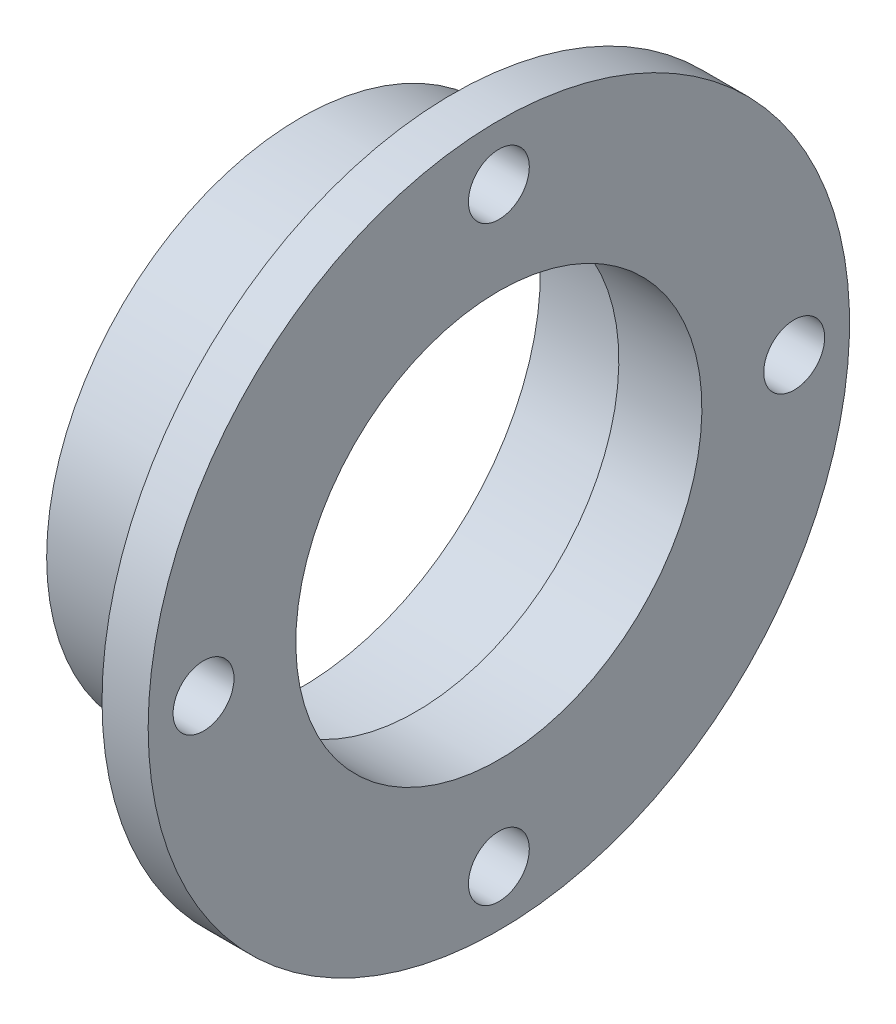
ISO-10303-21;
HEADER;
FILE_DESCRIPTION(('STEP AP214'),'2;1');
FILE_NAME('part.step','',(''),(''),'','','');
FILE_SCHEMA(('AUTOMOTIVE_DESIGN { 1 0 10303 214 1 1 1 1 }'));
ENDSEC;
DATA;
#1=APPLICATION_CONTEXT('core data for automotive mechanical design processes');
#2=APPLICATION_PROTOCOL_DEFINITION('international standard','automotive_design',2000,#1);
#3=PRODUCT_CONTEXT('',#1,'mechanical');
#4=PRODUCT('Part','Part','',(#3));
#5=PRODUCT_RELATED_PRODUCT_CATEGORY('part','',(#4));
#6=PRODUCT_DEFINITION_FORMATION('','',#4);
#7=PRODUCT_DEFINITION_CONTEXT('part definition',#1,'design');
#8=PRODUCT_DEFINITION('design','',#6,#7);
#9=PRODUCT_DEFINITION_SHAPE('','',#8);
#10=(LENGTH_UNIT() NAMED_UNIT(*) SI_UNIT(.MILLI.,.METRE.));
#11=(NAMED_UNIT(*) PLANE_ANGLE_UNIT() SI_UNIT($,.RADIAN.));
#12=(NAMED_UNIT(*) SI_UNIT($,.STERADIAN.) SOLID_ANGLE_UNIT());
#13=UNCERTAINTY_MEASURE_WITH_UNIT(LENGTH_MEASURE(1.E-05),#10,'distance_accuracy_value','');
#14=(GEOMETRIC_REPRESENTATION_CONTEXT(3) GLOBAL_UNCERTAINTY_ASSIGNED_CONTEXT((#13)) GLOBAL_UNIT_ASSIGNED_CONTEXT((#10,
#11,#12)) REPRESENTATION_CONTEXT('',''));
#15=CARTESIAN_POINT('',(0.,0.,0.));
#16=DIRECTION('',(0.,0.,1.));
#17=DIRECTION('',(1.,0.,0.));
#18=AXIS2_PLACEMENT_3D('',#15,#16,#17);
#19=CARTESIAN_POINT('',(0.,0.,0.));
#20=DIRECTION('',(-1.,0.,0.));
#21=DIRECTION('',(0.,0.,1.));
#22=AXIS2_PLACEMENT_3D('',#19,#20,#21);
#23=CYLINDRICAL_SURFACE('',#22,38.);
#24=CARTESIAN_POINT('',(-5.,0.,0.));
#25=DIRECTION('',(-1.,0.,0.));
#26=DIRECTION('',(0.,0.,1.));
#27=AXIS2_PLACEMENT_3D('',#24,#25,#26);
#28=CIRCLE('',#27,38.);
#29=CARTESIAN_POINT('',(-5.,0.,38.));
#30=VERTEX_POINT('',#29);
#31=EDGE_CURVE('E81',#30,#30,#28,.T.);
#32=ORIENTED_EDGE('',*,*,#31,.F.);
#33=EDGE_LOOP('',(#32));
#34=FACE_BOUND('',#33,.T.);
#35=CARTESIAN_POINT('',(0.,0.,0.));
#36=DIRECTION('',(-1.,0.,0.));
#37=DIRECTION('',(0.,0.,1.));
#38=AXIS2_PLACEMENT_3D('',#35,#36,#37);
#39=CIRCLE('',#38,38.);
#40=CARTESIAN_POINT('',(0.,0.,38.));
#41=VERTEX_POINT('',#40);
#42=EDGE_CURVE('E10',#41,#41,#39,.T.);
#43=ORIENTED_EDGE('',*,*,#42,.T.);
#44=EDGE_LOOP('',(#43));
#45=FACE_BOUND('',#44,.T.);
#46=ADVANCED_FACE('F29',(#34,#45),#23,.T.);
#47=CARTESIAN_POINT('',(0.,0.,0.));
#48=DIRECTION('',(-1.,0.,0.));
#49=DIRECTION('',(0.,0.,1.));
#50=AXIS2_PLACEMENT_3D('',#47,#48,#49);
#51=PLANE('',#50);
#52=CARTESIAN_POINT('',(0.,3.35182402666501E-13,-32.));
#53=DIRECTION('',(1.,0.,0.));
#54=DIRECTION('',(0.,0.,-1.));
#55=AXIS2_PLACEMENT_3D('',#52,#53,#54);
#56=CIRCLE('',#55,3.3);
#57=CARTESIAN_POINT('',(0.,3.35182402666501E-13,-35.3));
#58=VERTEX_POINT('',#57);
#59=EDGE_CURVE('E65',#58,#58,#56,.T.);
#60=ORIENTED_EDGE('',*,*,#59,.F.);
#61=EDGE_LOOP('',(#60));
#62=FACE_BOUND('',#61,.T.);
#63=CARTESIAN_POINT('',(0.,-32.,-2.23454935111E-13));
#64=DIRECTION('',(1.,0.,0.));
#65=DIRECTION('',(0.,0.,-1.));
#66=AXIS2_PLACEMENT_3D('',#63,#64,#65);
#67=CIRCLE('',#66,3.3);
#68=CARTESIAN_POINT('',(0.,-32.,-3.30000000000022));
#69=VERTEX_POINT('',#68);
#70=EDGE_CURVE('E55',#69,#69,#67,.T.);
#71=ORIENTED_EDGE('',*,*,#70,.F.);
#72=EDGE_LOOP('',(#71));
#73=FACE_BOUND('',#72,.T.);
#74=CARTESIAN_POINT('',(0.,-1.117274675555E-13,32.));
#75=DIRECTION('',(1.,0.,0.));
#76=DIRECTION('',(0.,0.,-1.));
#77=AXIS2_PLACEMENT_3D('',#74,#75,#76);
#78=CIRCLE('',#77,3.3);
#79=CARTESIAN_POINT('',(0.,-1.117274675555E-13,28.7));
#80=VERTEX_POINT('',#79);
#81=EDGE_CURVE('E52',#80,#80,#78,.T.);
#82=ORIENTED_EDGE('',*,*,#81,.F.);
#83=EDGE_LOOP('',(#82));
#84=FACE_BOUND('',#83,.T.);
#85=CARTESIAN_POINT('',(0.,32.,0.));
#86=DIRECTION('',(1.,0.,0.));
#87=DIRECTION('',(0.,0.,-1.));
#88=AXIS2_PLACEMENT_3D('',#85,#86,#87);
#89=CIRCLE('',#88,3.3);
#90=CARTESIAN_POINT('',(0.,32.,-3.3));
#91=VERTEX_POINT('',#90);
#92=EDGE_CURVE('E49',#91,#91,#89,.T.);
#93=ORIENTED_EDGE('',*,*,#92,.F.);
#94=EDGE_LOOP('',(#93));
#95=FACE_BOUND('',#94,.T.);
#96=CARTESIAN_POINT('',(0.,0.,0.));
#97=DIRECTION('',(1.,0.,0.));
#98=DIRECTION('',(0.,1.,0.));
#99=AXIS2_PLACEMENT_3D('',#96,#97,#98);
#100=CIRCLE('',#99,22.);
#101=CARTESIAN_POINT('',(0.,22.,0.));
#102=VERTEX_POINT('',#101);
#103=EDGE_CURVE('E78',#102,#102,#100,.T.);
#104=ORIENTED_EDGE('',*,*,#103,.F.);
#105=EDGE_LOOP('',(#104));
#106=FACE_BOUND('',#105,.T.);
#107=ORIENTED_EDGE('',*,*,#42,.F.);
#108=EDGE_LOOP('',(#107));
#109=FACE_BOUND('',#108,.T.);
#110=ADVANCED_FACE('F97',(#62,#73,#84,#95,#106,#109),#51,.F.);
#111=CARTESIAN_POINT('',(-21.5,27.5,0.));
#112=DIRECTION('',(1.,0.,0.));
#113=DIRECTION('',(0.,0.,-1.));
#114=AXIS2_PLACEMENT_3D('',#111,#112,#113);
#115=PLANE('',#114);
#116=CARTESIAN_POINT('',(-21.5,0.,0.));
#117=DIRECTION('',(1.,0.,0.));
#118=DIRECTION('',(0.,1.,0.));
#119=AXIS2_PLACEMENT_3D('',#116,#117,#118);
#120=CIRCLE('',#119,26.);
#121=CARTESIAN_POINT('',(-21.5,26.,0.));
#122=VERTEX_POINT('',#121);
#123=EDGE_CURVE('E48',#122,#122,#120,.T.);
#124=ORIENTED_EDGE('',*,*,#123,.T.);
#125=EDGE_LOOP('',(#124));
#126=FACE_BOUND('',#125,.T.);
#127=CARTESIAN_POINT('',(-21.5,0.,0.));
#128=DIRECTION('',(-1.,0.,0.));
#129=DIRECTION('',(0.,0.,1.));
#130=AXIS2_PLACEMENT_3D('',#127,#128,#129);
#131=CIRCLE('',#130,27.5);
#132=CARTESIAN_POINT('',(-21.5,0.,27.5));
#133=VERTEX_POINT('',#132);
#134=EDGE_CURVE('E36',#133,#133,#131,.T.);
#135=ORIENTED_EDGE('',*,*,#134,.T.);
#136=EDGE_LOOP('',(#135));
#137=FACE_BOUND('',#136,.T.);
#138=ADVANCED_FACE('F102',(#126,#137),#115,.F.);
#139=CARTESIAN_POINT('',(0.,0.,0.));
#140=DIRECTION('',(-1.,0.,0.));
#141=DIRECTION('',(0.,0.,1.));
#142=AXIS2_PLACEMENT_3D('',#139,#140,#141);
#143=CYLINDRICAL_SURFACE('',#142,27.5);
#144=ORIENTED_EDGE('',*,*,#134,.F.);
#145=EDGE_LOOP('',(#144));
#146=FACE_BOUND('',#145,.T.);
#147=CARTESIAN_POINT('',(-5.,0.,0.));
#148=DIRECTION('',(-1.,0.,0.));
#149=DIRECTION('',(0.,0.,1.));
#150=AXIS2_PLACEMENT_3D('',#147,#148,#149);
#151=CIRCLE('',#150,27.5);
#152=CARTESIAN_POINT('',(-5.,0.,27.5));
#153=VERTEX_POINT('',#152);
#154=EDGE_CURVE('E41',#153,#153,#151,.T.);
#155=ORIENTED_EDGE('',*,*,#154,.T.);
#156=EDGE_LOOP('',(#155));
#157=FACE_BOUND('',#156,.T.);
#158=ADVANCED_FACE('F86',(#146,#157),#143,.T.);
#159=CARTESIAN_POINT('',(-5.,38.,0.));
#160=DIRECTION('',(1.,0.,0.));
#161=DIRECTION('',(0.,0.,-1.));
#162=AXIS2_PLACEMENT_3D('',#159,#160,#161);
#163=PLANE('',#162);
#164=CARTESIAN_POINT('',(-5.,3.35182402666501E-13,-32.));
#165=DIRECTION('',(1.,0.,0.));
#166=DIRECTION('',(0.,0.,-1.));
#167=AXIS2_PLACEMENT_3D('',#164,#165,#166);
#168=CIRCLE('',#167,3.3);
#169=CARTESIAN_POINT('',(-5.,3.35182402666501E-13,-35.3));
#170=VERTEX_POINT('',#169);
#171=EDGE_CURVE('E32',#170,#170,#168,.T.);
#172=ORIENTED_EDGE('',*,*,#171,.T.);
#173=EDGE_LOOP('',(#172));
#174=FACE_BOUND('',#173,.T.);
#175=CARTESIAN_POINT('',(-5.,-32.,-2.23454935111E-13));
#176=DIRECTION('',(1.,0.,0.));
#177=DIRECTION('',(0.,0.,-1.));
#178=AXIS2_PLACEMENT_3D('',#175,#176,#177);
#179=CIRCLE('',#178,3.3);
#180=CARTESIAN_POINT('',(-5.,-32.,-3.30000000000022));
#181=VERTEX_POINT('',#180);
#182=EDGE_CURVE('E53',#181,#181,#179,.T.);
#183=ORIENTED_EDGE('',*,*,#182,.T.);
#184=EDGE_LOOP('',(#183));
#185=FACE_BOUND('',#184,.T.);
#186=CARTESIAN_POINT('',(-5.,-1.117274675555E-13,32.));
#187=DIRECTION('',(1.,0.,0.));
#188=DIRECTION('',(0.,0.,-1.));
#189=AXIS2_PLACEMENT_3D('',#186,#187,#188);
#190=CIRCLE('',#189,3.3);
#191=CARTESIAN_POINT('',(-5.,-1.117274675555E-13,28.7));
#192=VERTEX_POINT('',#191);
#193=EDGE_CURVE('E50',#192,#192,#190,.T.);
#194=ORIENTED_EDGE('',*,*,#193,.T.);
#195=EDGE_LOOP('',(#194));
#196=FACE_BOUND('',#195,.T.);
#197=CARTESIAN_POINT('',(-5.,32.,0.));
#198=DIRECTION('',(1.,0.,0.));
#199=DIRECTION('',(0.,0.,-1.));
#200=AXIS2_PLACEMENT_3D('',#197,#198,#199);
#201=CIRCLE('',#200,3.3);
#202=CARTESIAN_POINT('',(-5.,32.,-3.3));
#203=VERTEX_POINT('',#202);
#204=EDGE_CURVE('E45',#203,#203,#201,.T.);
#205=ORIENTED_EDGE('',*,*,#204,.T.);
#206=EDGE_LOOP('',(#205));
#207=FACE_BOUND('',#206,.T.);
#208=ORIENTED_EDGE('',*,*,#154,.F.);
#209=EDGE_LOOP('',(#208));
#210=FACE_BOUND('',#209,.T.);
#211=ORIENTED_EDGE('',*,*,#31,.T.);
#212=EDGE_LOOP('',(#211));
#213=FACE_BOUND('',#212,.T.);
#214=ADVANCED_FACE('F88',(#174,#185,#196,#207,#210,#213),#163,.F.);
#215=CARTESIAN_POINT('',(0.,0.,0.));
#216=DIRECTION('',(1.,0.,0.));
#217=DIRECTION('',(0.,1.,0.));
#218=AXIS2_PLACEMENT_3D('',#215,#216,#217);
#219=CYLINDRICAL_SURFACE('',#218,22.);
#220=CARTESIAN_POINT('',(-9.,0.,0.));
#221=DIRECTION('',(1.,0.,0.));
#222=DIRECTION('',(0.,1.,0.));
#223=AXIS2_PLACEMENT_3D('',#220,#221,#222);
#224=CIRCLE('',#223,22.);
#225=CARTESIAN_POINT('',(-9.,22.,0.));
#226=VERTEX_POINT('',#225);
#227=EDGE_CURVE('E75',#226,#226,#224,.T.);
#228=ORIENTED_EDGE('',*,*,#227,.F.);
#229=EDGE_LOOP('',(#228));
#230=FACE_BOUND('',#229,.T.);
#231=ORIENTED_EDGE('',*,*,#103,.T.);
#232=EDGE_LOOP('',(#231));
#233=FACE_BOUND('',#232,.T.);
#234=ADVANCED_FACE('F91',(#230,#233),#219,.F.);
#235=CARTESIAN_POINT('',(-9.,22.,0.));
#236=DIRECTION('',(1.,0.,0.));
#237=DIRECTION('',(0.,1.,0.));
#238=AXIS2_PLACEMENT_3D('',#235,#236,#237);
#239=PLANE('',#238);
#240=CARTESIAN_POINT('',(-9.,0.,0.));
#241=DIRECTION('',(1.,0.,0.));
#242=DIRECTION('',(0.,1.,0.));
#243=AXIS2_PLACEMENT_3D('',#240,#241,#242);
#244=CIRCLE('',#243,26.);
#245=CARTESIAN_POINT('',(-9.,26.,0.));
#246=VERTEX_POINT('',#245);
#247=EDGE_CURVE('E72',#246,#246,#244,.T.);
#248=ORIENTED_EDGE('',*,*,#247,.F.);
#249=EDGE_LOOP('',(#248));
#250=FACE_BOUND('',#249,.T.);
#251=ORIENTED_EDGE('',*,*,#227,.T.);
#252=EDGE_LOOP('',(#251));
#253=FACE_BOUND('',#252,.T.);
#254=ADVANCED_FACE('F117',(#250,#253),#239,.F.);
#255=CARTESIAN_POINT('',(0.,0.,0.));
#256=DIRECTION('',(1.,0.,0.));
#257=DIRECTION('',(0.,1.,0.));
#258=AXIS2_PLACEMENT_3D('',#255,#256,#257);
#259=CYLINDRICAL_SURFACE('',#258,26.);
#260=ORIENTED_EDGE('',*,*,#123,.F.);
#261=EDGE_LOOP('',(#260));
#262=FACE_BOUND('',#261,.T.);
#263=ORIENTED_EDGE('',*,*,#247,.T.);
#264=EDGE_LOOP('',(#263));
#265=FACE_BOUND('',#264,.T.);
#266=ADVANCED_FACE('F121',(#262,#265),#259,.F.);
#267=CARTESIAN_POINT('',(0.,32.,0.));
#268=DIRECTION('',(1.,0.,0.));
#269=DIRECTION('',(0.,0.,-1.));
#270=AXIS2_PLACEMENT_3D('',#267,#268,#269);
#271=CYLINDRICAL_SURFACE('',#270,3.3);
#272=ORIENTED_EDGE('',*,*,#92,.T.);
#273=EDGE_LOOP('',(#272));
#274=FACE_BOUND('',#273,.T.);
#275=ORIENTED_EDGE('',*,*,#204,.F.);
#276=EDGE_LOOP('',(#275));
#277=FACE_BOUND('',#276,.T.);
#278=ADVANCED_FACE('F125',(#274,#277),#271,.F.);
#279=CARTESIAN_POINT('',(0.,-1.117274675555E-13,32.));
#280=DIRECTION('',(1.,0.,0.));
#281=DIRECTION('',(0.,0.,-1.));
#282=AXIS2_PLACEMENT_3D('',#279,#280,#281);
#283=CYLINDRICAL_SURFACE('',#282,3.3);
#284=ORIENTED_EDGE('',*,*,#81,.T.);
#285=EDGE_LOOP('',(#284));
#286=FACE_BOUND('',#285,.T.);
#287=ORIENTED_EDGE('',*,*,#193,.F.);
#288=EDGE_LOOP('',(#287));
#289=FACE_BOUND('',#288,.T.);
#290=ADVANCED_FACE('F128',(#286,#289),#283,.F.);
#291=CARTESIAN_POINT('',(0.,-32.,-2.23454935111E-13));
#292=DIRECTION('',(1.,0.,0.));
#293=DIRECTION('',(0.,0.,-1.));
#294=AXIS2_PLACEMENT_3D('',#291,#292,#293);
#295=CYLINDRICAL_SURFACE('',#294,3.3);
#296=ORIENTED_EDGE('',*,*,#70,.T.);
#297=EDGE_LOOP('',(#296));
#298=FACE_BOUND('',#297,.T.);
#299=ORIENTED_EDGE('',*,*,#182,.F.);
#300=EDGE_LOOP('',(#299));
#301=FACE_BOUND('',#300,.T.);
#302=ADVANCED_FACE('F132',(#298,#301),#295,.F.);
#303=CARTESIAN_POINT('',(0.,3.35182402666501E-13,-32.));
#304=DIRECTION('',(1.,0.,0.));
#305=DIRECTION('',(0.,0.,-1.));
#306=AXIS2_PLACEMENT_3D('',#303,#304,#305);
#307=CYLINDRICAL_SURFACE('',#306,3.3);
#308=ORIENTED_EDGE('',*,*,#59,.T.);
#309=EDGE_LOOP('',(#308));
#310=FACE_BOUND('',#309,.T.);
#311=ORIENTED_EDGE('',*,*,#171,.F.);
#312=EDGE_LOOP('',(#311));
#313=FACE_BOUND('',#312,.T.);
#314=ADVANCED_FACE('F136',(#310,#313),#307,.F.);
#315=CLOSED_SHELL('',(#46,#110,#138,#158,#214,#234,#254,#266,#278,#290,#302,#314));
#316=MANIFOLD_SOLID_BREP('B2',#315);
#317=ADVANCED_BREP_SHAPE_REPRESENTATION('',(#18,#316),#14);
#318=SHAPE_DEFINITION_REPRESENTATION(#9,#317);
ENDSEC;
END-ISO-10303-21;
